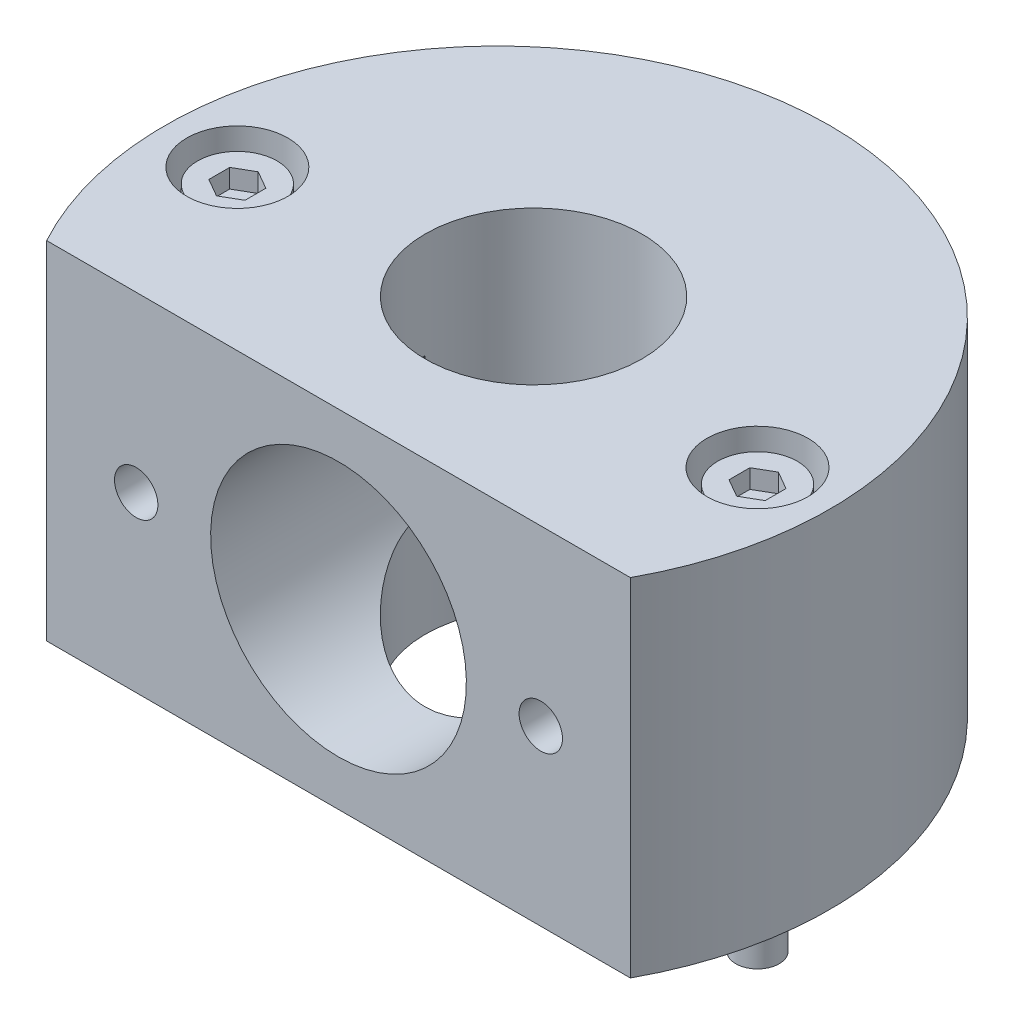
ISO-10303-21;
HEADER;
FILE_DESCRIPTION(('STEP AP214'),'2;1');
FILE_NAME('part.step','',(''),(''),'','','');
FILE_SCHEMA(('AUTOMOTIVE_DESIGN { 1 0 10303 214 1 1 1 1 }'));
ENDSEC;
DATA;
#1=APPLICATION_CONTEXT('core data for automotive mechanical design processes');
#2=APPLICATION_PROTOCOL_DEFINITION('international standard','automotive_design',2000,#1);
#3=PRODUCT_CONTEXT('',#1,'mechanical');
#4=PRODUCT('Part','Part','',(#3));
#5=PRODUCT_RELATED_PRODUCT_CATEGORY('part','',(#4));
#6=PRODUCT_DEFINITION_FORMATION('','',#4);
#7=PRODUCT_DEFINITION_CONTEXT('part definition',#1,'design');
#8=PRODUCT_DEFINITION('design','',#6,#7);
#9=PRODUCT_DEFINITION_SHAPE('','',#8);
#10=(LENGTH_UNIT() NAMED_UNIT(*) SI_UNIT(.MILLI.,.METRE.));
#11=(NAMED_UNIT(*) PLANE_ANGLE_UNIT() SI_UNIT($,.RADIAN.));
#12=(NAMED_UNIT(*) SI_UNIT($,.STERADIAN.) SOLID_ANGLE_UNIT());
#13=UNCERTAINTY_MEASURE_WITH_UNIT(LENGTH_MEASURE(1.E-05),#10,'distance_accuracy_value','');
#14=(GEOMETRIC_REPRESENTATION_CONTEXT(3) GLOBAL_UNCERTAINTY_ASSIGNED_CONTEXT((#13)) GLOBAL_UNIT_ASSIGNED_CONTEXT((#10,
#11,#12)) REPRESENTATION_CONTEXT('',''));
#15=CARTESIAN_POINT('',(0.,0.,0.));
#16=DIRECTION('',(0.,0.,1.));
#17=DIRECTION('',(1.,0.,0.));
#18=AXIS2_PLACEMENT_3D('',#15,#16,#17);
#19=CARTESIAN_POINT('',(0.,0.,0.));
#20=DIRECTION('',(0.,1.,0.));
#21=DIRECTION('',(-1.,0.,0.));
#22=AXIS2_PLACEMENT_3D('',#19,#20,#21);
#23=PLANE('',#22);
#24=CARTESIAN_POINT('',(-18.,-1.25693328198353E-13,0.));
#25=DIRECTION('',(0.,1.,0.));
#26=DIRECTION('',(-1.,0.,0.));
#27=AXIS2_PLACEMENT_3D('',#24,#25,#26);
#28=CIRCLE('',#27,1.75);
#29=CARTESIAN_POINT('',(-19.75,-1.37913512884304E-13,0.));
#30=VERTEX_POINT('',#29);
#31=EDGE_CURVE('E416',#30,#30,#28,.T.);
#32=ORIENTED_EDGE('',*,*,#31,.T.);
#33=EDGE_LOOP('',(#32));
#34=FACE_BOUND('',#33,.T.);
#35=CARTESIAN_POINT('',(0.,0.,-2.5));
#36=DIRECTION('',(0.,1.,0.));
#37=DIRECTION('',(-1.,0.,0.));
#38=AXIS2_PLACEMENT_3D('',#35,#36,#37);
#39=CIRCLE('',#38,7.5);
#40=CARTESIAN_POINT('',(-7.5,0.,-2.5));
#41=VERTEX_POINT('',#40);
#42=EDGE_CURVE('E420',#41,#41,#39,.T.);
#43=ORIENTED_EDGE('',*,*,#42,.T.);
#44=EDGE_LOOP('',(#43));
#45=FACE_BOUND('',#44,.T.);
#46=CARTESIAN_POINT('',(18.,1.25693328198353E-13,0.));
#47=DIRECTION('',(0.,1.,0.));
#48=DIRECTION('',(-1.,0.,0.));
#49=AXIS2_PLACEMENT_3D('',#46,#47,#48);
#50=CIRCLE('',#49,1.75);
#51=CARTESIAN_POINT('',(16.25,1.13473143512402E-13,0.));
#52=VERTEX_POINT('',#51);
#53=EDGE_CURVE('E423',#52,#52,#50,.T.);
#54=ORIENTED_EDGE('',*,*,#53,.T.);
#55=EDGE_LOOP('',(#54));
#56=FACE_BOUND('',#55,.T.);
#57=CARTESIAN_POINT('',(0.,0.,0.));
#58=DIRECTION('',(0.,1.,0.));
#59=DIRECTION('',(-1.,0.,0.));
#60=AXIS2_PLACEMENT_3D('',#57,#58,#59);
#61=CIRCLE('',#60,23.);
#62=CARTESIAN_POINT('',(20.1990098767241,1.79455226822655E-13,11.));
#63=VERTEX_POINT('',#62);
#64=CARTESIAN_POINT('',(-20.1990098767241,-1.02642637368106E-13,11.));
#65=VERTEX_POINT('',#64);
#66=EDGE_CURVE('E28',#63,#65,#61,.T.);
#67=ORIENTED_EDGE('',*,*,#66,.F.);
#68=DIRECTION('',(1.,0.,0.));
#69=VECTOR('',#68,1.);
#70=CARTESIAN_POINT('',(20.1990098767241,1.79455226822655E-13,11.));
#71=LINE('',#70,#69);
#72=EDGE_CURVE('E445',#65,#63,#71,.T.);
#73=ORIENTED_EDGE('',*,*,#72,.F.);
#74=EDGE_LOOP('',(#67,#73));
#75=FACE_BOUND('',#74,.T.);
#76=ADVANCED_FACE('F14',(#34,#45,#56,#75),#23,.F.);
#77=CARTESIAN_POINT('',(-15.3,12.,5.));
#78=DIRECTION('',(0.,0.,-1.));
#79=DIRECTION('',(0.,-1.,0.));
#80=AXIS2_PLACEMENT_3D('',#77,#78,#79);
#81=PLANE('',#80);
#82=CARTESIAN_POINT('',(-14.,12.,5.));
#83=DIRECTION('',(0.,0.,1.));
#84=DIRECTION('',(0.,1.,0.));
#85=AXIS2_PLACEMENT_3D('',#82,#83,#84);
#86=CIRCLE('',#85,1.5);
#87=CARTESIAN_POINT('',(-14.,13.5,4.99999999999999));
#88=VERTEX_POINT('',#87);
#89=EDGE_CURVE('E246',#88,#88,#86,.T.);
#90=ORIENTED_EDGE('',*,*,#89,.T.);
#91=EDGE_LOOP('',(#90));
#92=FACE_BOUND('',#91,.T.);
#93=ADVANCED_FACE('F292',(#92),#81,.F.);
#94=CARTESIAN_POINT('',(-14.,12.,11.));
#95=DIRECTION('',(0.,0.,1.));
#96=DIRECTION('',(0.,1.,0.));
#97=AXIS2_PLACEMENT_3D('',#94,#95,#96);
#98=CYLINDRICAL_SURFACE('',#97,1.5);
#99=ORIENTED_EDGE('',*,*,#89,.F.);
#100=EDGE_LOOP('',(#99));
#101=FACE_BOUND('',#100,.T.);
#102=CARTESIAN_POINT('',(-14.,12.,11.));
#103=DIRECTION('',(0.,0.,-1.));
#104=DIRECTION('',(0.,-1.,0.));
#105=AXIS2_PLACEMENT_3D('',#102,#103,#104);
#106=CIRCLE('',#105,1.5);
#107=CARTESIAN_POINT('',(-14.,10.5,11.));
#108=VERTEX_POINT('',#107);
#109=EDGE_CURVE('E235',#108,#108,#106,.F.);
#110=ORIENTED_EDGE('',*,*,#109,.T.);
#111=EDGE_LOOP('',(#110));
#112=FACE_BOUND('',#111,.T.);
#113=ADVANCED_FACE('F295',(#101,#112),#98,.F.);
#114=CARTESIAN_POINT('',(18.,24.,0.));
#115=DIRECTION('',(0.,1.,0.));
#116=DIRECTION('',(-1.,0.,0.));
#117=AXIS2_PLACEMENT_3D('',#114,#115,#116);
#118=CYLINDRICAL_SURFACE('',#117,1.75);
#119=CARTESIAN_POINT('',(18.,20.,0.));
#120=DIRECTION('',(0.,1.,0.));
#121=DIRECTION('',(-1.,0.,0.));
#122=AXIS2_PLACEMENT_3D('',#119,#120,#121);
#123=CIRCLE('',#122,1.75);
#124=CARTESIAN_POINT('',(16.25,20.,0.));
#125=VERTEX_POINT('',#124);
#126=EDGE_CURVE('E135',#125,#125,#123,.F.);
#127=ORIENTED_EDGE('',*,*,#126,.F.);
#128=EDGE_LOOP('',(#127));
#129=FACE_BOUND('',#128,.T.);
#130=ORIENTED_EDGE('',*,*,#53,.F.);
#131=EDGE_LOOP('',(#130));
#132=FACE_BOUND('',#131,.T.);
#133=ADVANCED_FACE('F311',(#129,#132),#118,.F.);
#134=CARTESIAN_POINT('',(14.4999999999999,20.,0.));
#135=DIRECTION('',(0.,-1.,0.));
#136=DIRECTION('',(1.,0.,0.));
#137=AXIS2_PLACEMENT_3D('',#134,#135,#136);
#138=PLANE('',#137);
#139=CARTESIAN_POINT('',(18.,20.,0.));
#140=DIRECTION('',(0.,-1.,0.));
#141=DIRECTION('',(1.,0.,0.));
#142=AXIS2_PLACEMENT_3D('',#139,#140,#141);
#143=CIRCLE('',#142,2.75);
#144=CARTESIAN_POINT('',(20.75,20.,0.));
#145=VERTEX_POINT('',#144);
#146=EDGE_CURVE('E9',#145,#145,#143,.F.);
#147=ORIENTED_EDGE('',*,*,#146,.F.);
#148=EDGE_LOOP('',(#147));
#149=FACE_BOUND('',#148,.T.);
#150=CARTESIAN_POINT('',(18.,20.,0.));
#151=DIRECTION('',(0.,1.,0.));
#152=DIRECTION('',(-1.,0.,0.));
#153=AXIS2_PLACEMENT_3D('',#150,#151,#152);
#154=CIRCLE('',#153,3.5);
#155=CARTESIAN_POINT('',(14.5,20.,0.));
#156=VERTEX_POINT('',#155);
#157=EDGE_CURVE('E236',#156,#156,#154,.T.);
#158=ORIENTED_EDGE('',*,*,#157,.T.);
#159=EDGE_LOOP('',(#158));
#160=FACE_BOUND('',#159,.T.);
#161=ADVANCED_FACE('F308',(#149,#160),#138,.F.);
#162=CARTESIAN_POINT('',(18.,24.,0.));
#163=DIRECTION('',(0.,1.,0.));
#164=DIRECTION('',(-1.,0.,0.));
#165=AXIS2_PLACEMENT_3D('',#162,#163,#164);
#166=CYLINDRICAL_SURFACE('',#165,3.5);
#167=ORIENTED_EDGE('',*,*,#157,.F.);
#168=EDGE_LOOP('',(#167));
#169=FACE_BOUND('',#168,.T.);
#170=CARTESIAN_POINT('',(18.,24.,0.));
#171=DIRECTION('',(0.,1.,0.));
#172=DIRECTION('',(-1.,0.,0.));
#173=AXIS2_PLACEMENT_3D('',#170,#171,#172);
#174=CIRCLE('',#173,3.5);
#175=CARTESIAN_POINT('',(14.5,24.,0.));
#176=VERTEX_POINT('',#175);
#177=EDGE_CURVE('E425',#176,#176,#174,.T.);
#178=ORIENTED_EDGE('',*,*,#177,.T.);
#179=EDGE_LOOP('',(#178));
#180=FACE_BOUND('',#179,.T.);
#181=ADVANCED_FACE('F301',(#169,#180),#166,.F.);
#182=CARTESIAN_POINT('',(12.7,12.,5.));
#183=DIRECTION('',(0.,0.,-1.));
#184=DIRECTION('',(0.,-1.,0.));
#185=AXIS2_PLACEMENT_3D('',#182,#183,#184);
#186=PLANE('',#185);
#187=CARTESIAN_POINT('',(14.,12.0000000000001,5.));
#188=DIRECTION('',(0.,0.,1.));
#189=DIRECTION('',(0.,1.,0.));
#190=AXIS2_PLACEMENT_3D('',#187,#188,#189);
#191=CIRCLE('',#190,1.5);
#192=CARTESIAN_POINT('',(14.,13.5000000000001,4.99999999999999));
#193=VERTEX_POINT('',#192);
#194=EDGE_CURVE('E243',#193,#193,#191,.T.);
#195=ORIENTED_EDGE('',*,*,#194,.T.);
#196=EDGE_LOOP('',(#195));
#197=FACE_BOUND('',#196,.T.);
#198=ADVANCED_FACE('F297',(#197),#186,.F.);
#199=CARTESIAN_POINT('',(14.,12.0000000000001,11.));
#200=DIRECTION('',(0.,0.,1.));
#201=DIRECTION('',(0.,1.,0.));
#202=AXIS2_PLACEMENT_3D('',#199,#200,#201);
#203=CYLINDRICAL_SURFACE('',#202,1.5);
#204=ORIENTED_EDGE('',*,*,#194,.F.);
#205=EDGE_LOOP('',(#204));
#206=FACE_BOUND('',#205,.T.);
#207=CARTESIAN_POINT('',(14.,12.0000000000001,11.));
#208=DIRECTION('',(0.,0.,-1.));
#209=DIRECTION('',(0.,-1.,0.));
#210=AXIS2_PLACEMENT_3D('',#207,#208,#209);
#211=CIRCLE('',#210,1.5);
#212=CARTESIAN_POINT('',(14.,10.5000000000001,11.));
#213=VERTEX_POINT('',#212);
#214=EDGE_CURVE('E240',#213,#213,#211,.F.);
#215=ORIENTED_EDGE('',*,*,#214,.T.);
#216=EDGE_LOOP('',(#215));
#217=FACE_BOUND('',#216,.T.);
#218=ADVANCED_FACE('F300',(#206,#217),#203,.F.);
#219=CARTESIAN_POINT('',(-1.6759110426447E-13,24.,0.));
#220=DIRECTION('',(0.,1.,0.));
#221=DIRECTION('',(-1.,0.,0.));
#222=AXIS2_PLACEMENT_3D('',#219,#220,#221);
#223=PLANE('',#222);
#224=ORIENTED_EDGE('',*,*,#177,.F.);
#225=EDGE_LOOP('',(#224));
#226=FACE_BOUND('',#225,.T.);
#227=CARTESIAN_POINT('',(-1.6759110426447E-13,24.,0.));
#228=DIRECTION('',(0.,1.,0.));
#229=DIRECTION('',(-1.,0.,0.));
#230=AXIS2_PLACEMENT_3D('',#227,#228,#229);
#231=CIRCLE('',#230,23.);
#232=CARTESIAN_POINT('',(-20.1990098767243,24.,11.));
#233=VERTEX_POINT('',#232);
#234=CARTESIAN_POINT('',(20.199009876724,24.,11.));
#235=VERTEX_POINT('',#234);
#236=EDGE_CURVE('E438',#233,#235,#231,.F.);
#237=ORIENTED_EDGE('',*,*,#236,.F.);
#238=DIRECTION('',(-1.,0.,0.));
#239=VECTOR('',#238,1.);
#240=CARTESIAN_POINT('',(-1.6759110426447E-13,24.,11.));
#241=LINE('',#240,#239);
#242=EDGE_CURVE('E435',#235,#233,#241,.T.);
#243=ORIENTED_EDGE('',*,*,#242,.F.);
#244=EDGE_LOOP('',(#237,#243));
#245=FACE_BOUND('',#244,.T.);
#246=CARTESIAN_POINT('',(-1.6759110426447E-13,24.,-2.50000000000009));
#247=DIRECTION('',(0.,1.,0.));
#248=DIRECTION('',(-1.,0.,0.));
#249=AXIS2_PLACEMENT_3D('',#246,#247,#248);
#250=CIRCLE('',#249,7.5);
#251=CARTESIAN_POINT('',(-7.50000000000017,23.9999999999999,-2.50000000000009));
#252=VERTEX_POINT('',#251);
#253=EDGE_CURVE('E491',#252,#252,#250,.T.);
#254=ORIENTED_EDGE('',*,*,#253,.F.);
#255=EDGE_LOOP('',(#254));
#256=FACE_BOUND('',#255,.T.);
#257=CARTESIAN_POINT('',(-18.,24.,0.));
#258=DIRECTION('',(0.,1.,0.));
#259=DIRECTION('',(-1.,0.,0.));
#260=AXIS2_PLACEMENT_3D('',#257,#258,#259);
#261=CIRCLE('',#260,3.5);
#262=CARTESIAN_POINT('',(-21.5,24.,0.));
#263=VERTEX_POINT('',#262);
#264=EDGE_CURVE('E441',#263,#263,#261,.T.);
#265=ORIENTED_EDGE('',*,*,#264,.F.);
#266=EDGE_LOOP('',(#265));
#267=FACE_BOUND('',#266,.T.);
#268=ADVANCED_FACE('F458',(#226,#245,#256,#267),#223,.T.);
#269=CARTESIAN_POINT('',(-1.6759110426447E-13,24.,0.));
#270=DIRECTION('',(0.,-1.,0.));
#271=DIRECTION('',(1.,0.,0.));
#272=AXIS2_PLACEMENT_3D('',#269,#270,#271);
#273=CYLINDRICAL_SURFACE('',#272,23.);
#274=DIRECTION('',(0.,-1.,0.));
#275=VECTOR('',#274,1.);
#276=CARTESIAN_POINT('',(20.199009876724,24.,11.));
#277=LINE('',#276,#275);
#278=EDGE_CURVE('E253',#235,#63,#277,.T.);
#279=ORIENTED_EDGE('',*,*,#278,.T.);
#280=ORIENTED_EDGE('',*,*,#66,.T.);
#281=DIRECTION('',(0.,-1.,0.));
#282=VECTOR('',#281,1.);
#283=CARTESIAN_POINT('',(-20.1990098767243,24.,11.));
#284=LINE('',#283,#282);
#285=EDGE_CURVE('E255',#233,#65,#284,.T.);
#286=ORIENTED_EDGE('',*,*,#285,.F.);
#287=ORIENTED_EDGE('',*,*,#236,.T.);
#288=EDGE_LOOP('',(#279,#280,#286,#287));
#289=FACE_BOUND('',#288,.T.);
#290=ADVANCED_FACE('F460',(#289),#273,.T.);
#291=CARTESIAN_POINT('',(20.199009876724,24.,11.));
#292=DIRECTION('',(0.,0.,-1.));
#293=DIRECTION('',(0.,-1.,0.));
#294=AXIS2_PLACEMENT_3D('',#291,#292,#293);
#295=PLANE('',#294);
#296=ORIENTED_EDGE('',*,*,#109,.F.);
#297=EDGE_LOOP('',(#296));
#298=FACE_BOUND('',#297,.T.);
#299=ORIENTED_EDGE('',*,*,#214,.F.);
#300=EDGE_LOOP('',(#299));
#301=FACE_BOUND('',#300,.T.);
#302=CARTESIAN_POINT('',(0.,12.,11.));
#303=DIRECTION('',(0.,0.,-1.));
#304=DIRECTION('',(0.,-1.,0.));
#305=AXIS2_PLACEMENT_3D('',#302,#303,#304);
#306=CIRCLE('',#305,8.85);
#307=CARTESIAN_POINT('',(0.,3.15,11.));
#308=VERTEX_POINT('',#307);
#309=EDGE_CURVE('E439',#308,#308,#306,.F.);
#310=ORIENTED_EDGE('',*,*,#309,.F.);
#311=EDGE_LOOP('',(#310));
#312=FACE_BOUND('',#311,.T.);
#313=ORIENTED_EDGE('',*,*,#285,.T.);
#314=ORIENTED_EDGE('',*,*,#72,.T.);
#315=ORIENTED_EDGE('',*,*,#278,.F.);
#316=ORIENTED_EDGE('',*,*,#242,.T.);
#317=EDGE_LOOP('',(#313,#314,#315,#316));
#318=FACE_BOUND('',#317,.T.);
#319=ADVANCED_FACE('F290',(#298,#301,#312,#318),#295,.F.);
#320=CARTESIAN_POINT('',(0.,12.,-2.50000000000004));
#321=DIRECTION('',(0.,0.,1.));
#322=DIRECTION('',(0.,1.,0.));
#323=AXIS2_PLACEMENT_3D('',#320,#321,#322);
#324=PLANE('',#323);
#325=CARTESIAN_POINT('',(0.,12.,-2.50000000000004));
#326=DIRECTION('',(0.,0.,1.));
#327=DIRECTION('',(0.,1.,0.));
#328=AXIS2_PLACEMENT_3D('',#325,#326,#327);
#329=CIRCLE('',#328,8.85);
#330=CARTESIAN_POINT('',(7.5,7.30186207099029,-2.5));
#331=VERTEX_POINT('',#330);
#332=CARTESIAN_POINT('',(7.49999999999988,16.6981379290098,-2.50000000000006));
#333=VERTEX_POINT('',#332);
#334=EDGE_CURVE('E249',#331,#333,#329,.T.);
#335=ORIENTED_EDGE('',*,*,#334,.T.);
#336=DIRECTION('',(0.,-1.,0.));
#337=VECTOR('',#336,1.);
#338=CARTESIAN_POINT('',(7.49999999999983,24.,-2.50000000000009));
#339=LINE('',#338,#337);
#340=EDGE_CURVE('E258',#331,#333,#339,.F.);
#341=ORIENTED_EDGE('',*,*,#340,.F.);
#342=EDGE_LOOP('',(#335,#341));
#343=FACE_BOUND('',#342,.T.);
#344=ADVANCED_FACE('F285',(#343),#324,.T.);
#345=CARTESIAN_POINT('',(-7.50000000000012,16.6981379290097,-2.50000000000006));
#346=VERTEX_POINT('',#345);
#347=CARTESIAN_POINT('',(-7.5,7.30186207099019,-2.5));
#348=VERTEX_POINT('',#347);
#349=EDGE_CURVE('E250',#346,#348,#329,.T.);
#350=ORIENTED_EDGE('',*,*,#349,.T.);
#351=DIRECTION('',(0.,-1.,0.));
#352=VECTOR('',#351,1.);
#353=CARTESIAN_POINT('',(-7.50000000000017,24.,-2.50000000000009));
#354=LINE('',#353,#352);
#355=EDGE_CURVE('E494',#346,#348,#354,.T.);
#356=ORIENTED_EDGE('',*,*,#355,.F.);
#357=EDGE_LOOP('',(#350,#356));
#358=FACE_BOUND('',#357,.T.);
#359=ADVANCED_FACE('F289',(#358),#324,.T.);
#360=CARTESIAN_POINT('',(-1.6759110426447E-13,24.,-2.50000000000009));
#361=DIRECTION('',(0.,-1.,0.));
#362=DIRECTION('',(1.,0.,0.));
#363=AXIS2_PLACEMENT_3D('',#360,#361,#362);
#364=CYLINDRICAL_SURFACE('',#363,7.5);
#365=ORIENTED_EDGE('',*,*,#42,.F.);
#366=EDGE_LOOP('',(#365));
#367=FACE_BOUND('',#366,.T.);
#368=ORIENTED_EDGE('',*,*,#253,.T.);
#369=EDGE_LOOP('',(#368));
#370=FACE_BOUND('',#369,.T.);
#371=CARTESIAN_POINT('',(7.49999999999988,16.6981379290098,-2.50000000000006));
#372=CARTESIAN_POINT('',(7.50003127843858,16.6980387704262,-2.3698160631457));
#373=CARTESIAN_POINT('',(7.49661192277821,16.7035464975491,-2.23969529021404));
#374=CARTESIAN_POINT('',(7.48312650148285,16.7249971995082,-1.98092204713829));
#375=CARTESIAN_POINT('',(7.47307403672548,16.7409188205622,-1.85226711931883));
#376=CARTESIAN_POINT('',(7.44677775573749,16.7821071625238,-1.59917710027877));
#377=CARTESIAN_POINT('',(7.43063099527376,16.8072272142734,-1.47470756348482));
#378=CARTESIAN_POINT('',(7.3924963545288,16.8656676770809,-1.22857835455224));
#379=CARTESIAN_POINT('',(7.3705050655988,16.8989928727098,-1.10692036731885));
#380=CARTESIAN_POINT('',(7.31079461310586,16.9878554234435,-0.817038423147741));
#381=CARTESIAN_POINT('',(7.27033594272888,17.0468711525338,-0.650444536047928));
#382=CARTESIAN_POINT('',(7.17945037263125,17.1753436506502,-0.324176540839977));
#383=CARTESIAN_POINT('',(7.12901921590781,17.244804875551,-0.164505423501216));
#384=CARTESIAN_POINT('',(7.01848282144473,17.3918387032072,0.149301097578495));
#385=CARTESIAN_POINT('',(6.95830182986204,17.4694730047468,0.30338054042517));
#386=CARTESIAN_POINT('',(6.82906771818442,17.6300063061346,0.604956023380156));
#387=CARTESIAN_POINT('',(6.76001163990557,17.7129070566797,0.752449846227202));
#388=CARTESIAN_POINT('',(6.57777492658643,17.9230873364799,1.11119698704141));
#389=CARTESIAN_POINT('',(6.45944119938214,18.0523845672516,1.31866693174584));
#390=CARTESIAN_POINT('',(6.20443168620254,18.313549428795,1.72038298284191));
#391=CARTESIAN_POINT('',(6.06774752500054,18.4454182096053,1.91462298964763));
#392=CARTESIAN_POINT('',(5.77651287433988,18.707661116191,2.28937048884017));
#393=CARTESIAN_POINT('',(5.62200465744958,18.8380380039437,2.46990885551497));
#394=CARTESIAN_POINT('',(5.29485883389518,19.0943735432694,2.81707765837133));
#395=CARTESIAN_POINT('',(5.12222852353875,19.2203339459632,2.98371364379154));
#396=CARTESIAN_POINT('',(4.79840490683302,19.4382233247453,3.2672332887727));
#397=CARTESIAN_POINT('',(4.65073492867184,19.53158791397,3.38704693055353));
#398=CARTESIAN_POINT('',(4.34436568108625,19.7123671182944,3.61662605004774));
#399=CARTESIAN_POINT('',(4.18566873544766,19.7997829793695,3.72639363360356));
#400=CARTESIAN_POINT('',(3.85762049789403,19.9671285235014,3.93478713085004));
#401=CARTESIAN_POINT('',(3.68828004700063,20.0470656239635,4.03342410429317));
#402=CARTESIAN_POINT('',(3.33927056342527,20.1980423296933,4.21850150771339));
#403=CARTESIAN_POINT('',(3.15960348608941,20.2690836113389,4.30494423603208));
#404=CARTESIAN_POINT('',(2.82351416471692,20.3890528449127,4.45018482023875));
#405=CARTESIAN_POINT('',(2.66863460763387,20.4396670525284,4.51116555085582));
#406=CARTESIAN_POINT('',(2.35306329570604,20.5330330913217,4.62327996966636));
#407=CARTESIAN_POINT('',(2.19237275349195,20.5757865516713,4.67441569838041));
#408=CARTESIAN_POINT('',(1.86604430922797,20.6526565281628,4.76612622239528));
#409=CARTESIAN_POINT('',(1.70040833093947,20.6867763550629,4.80670506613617));
#410=CARTESIAN_POINT('',(1.36515530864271,20.7457311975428,4.87669779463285));
#411=CARTESIAN_POINT('',(1.19553821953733,20.7705661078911,4.90611155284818));
#412=CARTESIAN_POINT('',(0.85275224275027,20.8105176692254,4.95338059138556));
#413=CARTESIAN_POINT('',(0.679570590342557,20.8255890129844,4.97118198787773));
#414=CARTESIAN_POINT('',(0.331797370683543,20.8454928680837,4.99468366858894));
#415=CARTESIAN_POINT('',(0.157205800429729,20.8503253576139,5.00038392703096));
#416=CARTESIAN_POINT('',(-0.191918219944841,20.849640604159,4.99957590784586));
#417=CARTESIAN_POINT('',(-0.366450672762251,20.844123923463,4.9930682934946));
#418=CARTESIAN_POINT('',(-0.714008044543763,20.822868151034,4.96796806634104));
#419=CARTESIAN_POINT('',(-0.88703302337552,20.8071294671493,4.94937593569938));
#420=CARTESIAN_POINT('',(-1.21762250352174,20.767300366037,4.90224300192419));
#421=CARTESIAN_POINT('',(-1.37539084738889,20.7439064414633,4.87453103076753));
#422=CARTESIAN_POINT('',(-1.68753886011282,20.6890640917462,4.80942148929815));
#423=CARTESIAN_POINT('',(-1.84191737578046,20.6576129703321,4.77202067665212));
#424=CARTESIAN_POINT('',(-2.14635050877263,20.587204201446,4.68805260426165));
#425=CARTESIAN_POINT('',(-2.29640643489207,20.5482488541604,4.64148815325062));
#426=CARTESIAN_POINT('',(-2.59159062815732,20.4634378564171,4.53974891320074));
#427=CARTESIAN_POINT('',(-2.73671703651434,20.4175796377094,4.48457091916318));
#428=CARTESIAN_POINT('',(-3.18655095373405,20.2628025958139,4.29754369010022));
#429=CARTESIAN_POINT('',(-3.48134461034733,20.1423781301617,4.15092967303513));
#430=CARTESIAN_POINT('',(-4.04191540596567,19.8791873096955,3.82599443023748));
#431=CARTESIAN_POINT('',(-4.30766947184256,19.7364034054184,3.64764828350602));
#432=CARTESIAN_POINT('',(-4.74547468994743,19.4733316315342,3.31257573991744));
#433=CARTESIAN_POINT('',(-4.92422807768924,19.3564843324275,3.16178511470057));
#434=CARTESIAN_POINT('',(-5.26481425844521,19.1167121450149,2.84654883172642));
#435=CARTESIAN_POINT('',(-5.42664645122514,18.9937870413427,2.68210268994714));
#436=CARTESIAN_POINT('',(-5.73374238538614,18.7443249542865,2.34015859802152));
#437=CARTESIAN_POINT('',(-5.87896958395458,18.6177807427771,2.162633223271));
#438=CARTESIAN_POINT('',(-6.15245710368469,18.3643135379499,1.79531139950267));
#439=CARTESIAN_POINT('',(-6.28072299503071,18.2373906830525,1.60551900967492));
#440=CARTESIAN_POINT('',(-6.49194881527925,18.0162010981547,1.25970782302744));
#441=CARTESIAN_POINT('',(-6.57846356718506,17.9212849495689,1.1062652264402));
#442=CARTESIAN_POINT('',(-6.74130989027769,17.7351997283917,0.791824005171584));
#443=CARTESIAN_POINT('',(-6.81764025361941,17.6440311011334,0.63082448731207));
#444=CARTESIAN_POINT('',(-6.95953859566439,17.4680948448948,0.301236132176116));
#445=CARTESIAN_POINT('',(-7.02512981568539,17.3833136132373,0.132664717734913));
#446=CARTESIAN_POINT('',(-7.14502220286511,17.2231368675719,-0.212624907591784));
#447=CARTESIAN_POINT('',(-7.19933007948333,17.147735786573,-0.389338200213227));
#448=CARTESIAN_POINT('',(-7.31009274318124,16.9896842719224,-0.805443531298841));
#449=CARTESIAN_POINT('',(-7.36236133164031,16.9115734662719,-1.04781644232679));
#450=CARTESIAN_POINT('',(-7.42288236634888,16.8191984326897,-1.41991234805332));
#451=CARTESIAN_POINT('',(-7.44006429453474,16.7925583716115,-1.54518830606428));
#452=CARTESIAN_POINT('',(-7.46815879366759,16.7486619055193,-1.7980424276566));
#453=CARTESIAN_POINT('',(-7.47907563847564,16.7313991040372,-1.92561896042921));
#454=CARTESIAN_POINT('',(-7.49113000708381,16.7122751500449,-2.12787232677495));
#455=CARTESIAN_POINT('',(-7.49445068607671,16.7069881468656,-2.20211442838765));
#456=CARTESIAN_POINT('',(-7.49888794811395,16.6999133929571,-2.35089942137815));
#457=CARTESIAN_POINT('',(-7.50000248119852,16.6981288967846,-2.42544252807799));
#458=CARTESIAN_POINT('',(-7.50000000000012,16.6981379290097,-2.50000000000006));
#459=B_SPLINE_CURVE_WITH_KNOTS('',3,(#371,#372,#373,#374,#375,#376,#377,#378,#379,#380,#381,
#382,#383,#384,#385,#386,#387,#388,#389,#390,#391,#392,#393,#394,#395,#396,#397,#398,#399,#400,
#401,#402,#403,#404,#405,#406,#407,#408,#409,#410,#411,#412,#413,#414,#415,#416,#417,#418,#419,
#420,#421,#422,#423,#424,#425,#426,#427,#428,#429,#430,#431,#432,#433,#434,#435,#436,#437,#438,
#439,#440,#441,#442,#443,#444,#445,#446,#447,#448,#449,#450,#451,#452,#453,#454,#455,#456,#457,
#458),.UNSPECIFIED.,.F.,.F.,(4,2,2,2,2,2,2,2,2,2,2,2,2,2,2,2,2,2,2,2,2,2,2,2,2,2,2,2,2,2,2,2,2,
2,2,2,2,2,2,2,2,2,2,4),(0.,0.390289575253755,0.779781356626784,1.16331541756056,
1.54707365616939,2.09010849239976,2.63337563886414,3.18108636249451,3.7289801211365,
4.54268863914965,5.35676980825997,6.16895848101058,6.98082139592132,7.61581117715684,
8.25066754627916,8.88488744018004,9.51898763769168,10.0404098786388,10.5617239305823,
11.0828377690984,11.6039575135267,12.1274784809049,12.6510005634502,13.1744942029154,
13.6979669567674,14.1830815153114,14.6683586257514,15.1534872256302,15.6387967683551,
16.686368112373,17.7347658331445,18.5180746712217,19.3014112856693,20.0864399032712,
20.8712100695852,21.4711111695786,22.0710833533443,22.6697394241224,23.2680384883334,
24.0446944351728,24.4319548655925,24.8189508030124,25.0423589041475,25.2659744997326),.UNSPECIFIED.);
#460=EDGE_CURVE('E270',#333,#346,#459,.T.);
#461=ORIENTED_EDGE('',*,*,#460,.T.);
#462=ORIENTED_EDGE('',*,*,#355,.T.);
#463=CARTESIAN_POINT('',(-7.5,7.30186207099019,-2.5));
#464=CARTESIAN_POINT('',(-7.50003127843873,7.30196122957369,-2.36981606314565));
#465=CARTESIAN_POINT('',(-7.49661192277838,7.29645350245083,-2.239695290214));
#466=CARTESIAN_POINT('',(-7.48312650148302,7.27500280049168,-1.98092204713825));
#467=CARTESIAN_POINT('',(-7.47307403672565,7.25908117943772,-1.85226711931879));
#468=CARTESIAN_POINT('',(-7.44677775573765,7.21789283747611,-1.59917710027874));
#469=CARTESIAN_POINT('',(-7.43063099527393,7.19277278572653,-1.47470756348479));
#470=CARTESIAN_POINT('',(-7.39249635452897,7.13433232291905,-1.22857835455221));
#471=CARTESIAN_POINT('',(-7.37050506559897,7.1010071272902,-1.10692036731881));
#472=CARTESIAN_POINT('',(-7.31079461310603,7.01214457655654,-0.817038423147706));
#473=CARTESIAN_POINT('',(-7.27033594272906,6.95312884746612,-0.650444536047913));
#474=CARTESIAN_POINT('',(-7.17945037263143,6.82465634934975,-0.324176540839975));
#475=CARTESIAN_POINT('',(-7.12901921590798,6.75519512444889,-0.164505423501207));
#476=CARTESIAN_POINT('',(-7.0184828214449,6.60816129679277,0.149301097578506));
#477=CARTESIAN_POINT('',(-6.95830182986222,6.53052699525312,0.303380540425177));
#478=CARTESIAN_POINT('',(-6.8290677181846,6.36999369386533,0.604956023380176));
#479=CARTESIAN_POINT('',(-6.76001163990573,6.28709294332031,0.752449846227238));
#480=CARTESIAN_POINT('',(-6.57777492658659,6.07691266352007,1.11119698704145));
#481=CARTESIAN_POINT('',(-6.45944119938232,5.94761543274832,1.31866693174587));
#482=CARTESIAN_POINT('',(-6.20443168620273,5.68645057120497,1.72038298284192));
#483=CARTESIAN_POINT('',(-6.06774752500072,5.55458179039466,1.91462298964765));
#484=CARTESIAN_POINT('',(-5.77651287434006,5.29233888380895,2.28937048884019));
#485=CARTESIAN_POINT('',(-5.62200465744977,5.16196199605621,2.46990885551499));
#486=CARTESIAN_POINT('',(-5.29485883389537,4.90562645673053,2.81707765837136));
#487=CARTESIAN_POINT('',(-5.12222852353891,4.77966605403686,2.98371364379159));
#488=CARTESIAN_POINT('',(-4.79840490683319,4.5617766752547,3.26723328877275));
#489=CARTESIAN_POINT('',(-4.65073492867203,4.46841208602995,3.38704693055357));
#490=CARTESIAN_POINT('',(-4.34436568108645,4.28763288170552,3.61662605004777));
#491=CARTESIAN_POINT('',(-4.18566873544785,4.2002170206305,3.72639363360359));
#492=CARTESIAN_POINT('',(-3.85762049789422,4.03287147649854,3.93478713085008));
#493=CARTESIAN_POINT('',(-3.68828004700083,3.95293437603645,4.03342410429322));
#494=CARTESIAN_POINT('',(-3.33927056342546,3.8019576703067,4.21850150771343));
#495=CARTESIAN_POINT('',(-3.15960348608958,3.73091638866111,4.30494423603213));
#496=CARTESIAN_POINT('',(-2.82351416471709,3.6109471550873,4.4501848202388));
#497=CARTESIAN_POINT('',(-2.66863460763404,3.56033294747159,4.51116555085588));
#498=CARTESIAN_POINT('',(-2.35306329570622,3.46696690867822,4.62327996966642));
#499=CARTESIAN_POINT('',(-2.19237275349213,3.42421344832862,4.67441569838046));
#500=CARTESIAN_POINT('',(-1.86604430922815,3.34734347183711,4.76612622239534));
#501=CARTESIAN_POINT('',(-1.70040833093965,3.31322364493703,4.80670506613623));
#502=CARTESIAN_POINT('',(-1.36515530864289,3.25426880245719,4.87669779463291));
#503=CARTESIAN_POINT('',(-1.1955382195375,3.22943389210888,4.90611155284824));
#504=CARTESIAN_POINT('',(-0.852752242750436,3.18948233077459,4.95338059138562));
#505=CARTESIAN_POINT('',(-0.679570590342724,3.17441098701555,4.97118198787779));
#506=CARTESIAN_POINT('',(-0.331797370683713,3.15450713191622,4.994683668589));
#507=CARTESIAN_POINT('',(-0.157205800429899,3.14967464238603,5.00038392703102));
#508=CARTESIAN_POINT('',(0.191918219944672,3.150359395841,4.99957590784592));
#509=CARTESIAN_POINT('',(0.366450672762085,3.15587607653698,4.99306829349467));
#510=CARTESIAN_POINT('',(0.714008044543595,3.17713184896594,4.96796806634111));
#511=CARTESIAN_POINT('',(0.887033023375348,3.19287053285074,4.94937593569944));
#512=CARTESIAN_POINT('',(1.21762250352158,3.23269963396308,4.90224300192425));
#513=CARTESIAN_POINT('',(1.37539084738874,3.25609355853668,4.87453103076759));
#514=CARTESIAN_POINT('',(1.68753886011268,3.31093590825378,4.80942148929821));
#515=CARTESIAN_POINT('',(1.84191737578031,3.34238702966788,4.77202067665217));
#516=CARTESIAN_POINT('',(2.14635050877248,3.41279579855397,4.6880526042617));
#517=CARTESIAN_POINT('',(2.29640643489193,3.45175114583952,4.64148815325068));
#518=CARTESIAN_POINT('',(2.59159062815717,3.53656214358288,4.53974891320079));
#519=CARTESIAN_POINT('',(2.73671703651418,3.5824203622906,4.48457091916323));
#520=CARTESIAN_POINT('',(3.18655095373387,3.73719740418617,4.29754369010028));
#521=CARTESIAN_POINT('',(3.48134461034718,3.85762186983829,4.15092967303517));
#522=CARTESIAN_POINT('',(4.04191540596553,4.12081269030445,3.82599443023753));
#523=CARTESIAN_POINT('',(4.30766947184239,4.26359659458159,3.64764828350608));
#524=CARTESIAN_POINT('',(4.74547468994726,4.5266683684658,3.31257573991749));
#525=CARTESIAN_POINT('',(4.92422807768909,4.64351566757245,3.1617851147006));
#526=CARTESIAN_POINT('',(5.26481425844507,4.88328785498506,2.84654883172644));
#527=CARTESIAN_POINT('',(5.426646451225,5.00621295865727,2.68210268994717));
#528=CARTESIAN_POINT('',(5.73374238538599,5.25567504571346,2.34015859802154));
#529=CARTESIAN_POINT('',(5.87896958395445,5.38221925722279,2.16263322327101));
#530=CARTESIAN_POINT('',(6.15245710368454,5.63568646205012,1.7953113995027));
#531=CARTESIAN_POINT('',(6.28072299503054,5.76260931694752,1.60551900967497));
#532=CARTESIAN_POINT('',(6.49194881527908,5.98379890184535,1.25970782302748));
#533=CARTESIAN_POINT('',(6.5784635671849,6.07871505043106,1.10626522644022));
#534=CARTESIAN_POINT('',(6.74130989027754,6.26480027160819,0.791824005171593));
#535=CARTESIAN_POINT('',(6.81764025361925,6.35596889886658,0.630824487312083));
#536=CARTESIAN_POINT('',(6.95953859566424,6.53190515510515,0.301236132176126));
#537=CARTESIAN_POINT('',(7.02512981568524,6.61668638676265,0.132664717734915));
#538=CARTESIAN_POINT('',(7.14502220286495,6.77686313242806,-0.212624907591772));
#539=CARTESIAN_POINT('',(7.19933007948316,6.85226421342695,-0.389338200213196));
#540=CARTESIAN_POINT('',(7.31009274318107,7.01031572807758,-0.8054435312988));
#541=CARTESIAN_POINT('',(7.36236133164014,7.08842653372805,-1.04781644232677));
#542=CARTESIAN_POINT('',(7.42288236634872,7.18080156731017,-1.41991234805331));
#543=CARTESIAN_POINT('',(7.44006429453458,7.20744162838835,-1.54518830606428));
#544=CARTESIAN_POINT('',(7.46815879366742,7.25133809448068,-1.79804242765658));
#545=CARTESIAN_POINT('',(7.47907563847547,7.26860089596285,-1.92561896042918));
#546=CARTESIAN_POINT('',(7.49113000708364,7.28772484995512,-2.12787232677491));
#547=CARTESIAN_POINT('',(7.49445068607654,7.29301185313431,-2.20211442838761));
#548=CARTESIAN_POINT('',(7.49888794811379,7.30008660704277,-2.3508994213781));
#549=CARTESIAN_POINT('',(7.50000248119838,7.30187110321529,-2.42544252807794));
#550=CARTESIAN_POINT('',(7.5,7.30186207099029,-2.5));
#551=B_SPLINE_CURVE_WITH_KNOTS('',3,(#463,#464,#465,#466,#467,#468,#469,#470,#471,#472,#473,
#474,#475,#476,#477,#478,#479,#480,#481,#482,#483,#484,#485,#486,#487,#488,#489,#490,#491,#492,
#493,#494,#495,#496,#497,#498,#499,#500,#501,#502,#503,#504,#505,#506,#507,#508,#509,#510,#511,
#512,#513,#514,#515,#516,#517,#518,#519,#520,#521,#522,#523,#524,#525,#526,#527,#528,#529,#530,
#531,#532,#533,#534,#535,#536,#537,#538,#539,#540,#541,#542,#543,#544,#545,#546,#547,#548,#549,
#550),.UNSPECIFIED.,.F.,.F.,(4,2,2,2,2,2,2,2,2,2,2,2,2,2,2,2,2,2,2,2,2,2,2,2,2,2,2,2,2,2,2,2,2,
2,2,2,2,2,2,2,2,2,2,4),(0.,0.390289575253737,0.779781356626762,1.16331541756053,
1.54707365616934,2.09010849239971,2.63337563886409,3.18108636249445,3.72898012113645,
4.5426886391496,5.35676980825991,6.16895848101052,6.98082139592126,7.61581117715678,
8.2506675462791,8.88488744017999,9.51898763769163,10.0404098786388,10.5617239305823,
11.0828377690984,11.6039575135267,12.1274784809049,12.6510005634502,13.1744942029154,
13.6979669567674,14.1830815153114,14.6683586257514,15.1534872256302,15.6387967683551,
16.686368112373,17.7347658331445,18.5180746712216,19.3014112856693,20.0864399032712,
20.8712100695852,21.4711111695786,22.0710833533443,22.6697394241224,23.2680384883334,
24.0446944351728,24.4319548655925,24.8189508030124,25.0423589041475,25.2659744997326),.UNSPECIFIED.);
#552=EDGE_CURVE('E261',#348,#331,#551,.T.);
#553=ORIENTED_EDGE('',*,*,#552,.T.);
#554=ORIENTED_EDGE('',*,*,#340,.T.);
#555=EDGE_LOOP('',(#461,#462,#553,#554));
#556=FACE_BOUND('',#555,.T.);
#557=ADVANCED_FACE('F276',(#367,#370,#556),#364,.F.);
#558=CARTESIAN_POINT('',(0.,12.,11.));
#559=DIRECTION('',(0.,0.,-1.));
#560=DIRECTION('',(0.,-1.,0.));
#561=AXIS2_PLACEMENT_3D('',#558,#559,#560);
#562=CYLINDRICAL_SURFACE('',#561,8.85);
#563=ORIENTED_EDGE('',*,*,#309,.T.);
#564=EDGE_LOOP('',(#563));
#565=FACE_BOUND('',#564,.T.);
#566=ORIENTED_EDGE('',*,*,#334,.F.);
#567=ORIENTED_EDGE('',*,*,#552,.F.);
#568=ORIENTED_EDGE('',*,*,#349,.F.);
#569=ORIENTED_EDGE('',*,*,#460,.F.);
#570=EDGE_LOOP('',(#566,#567,#568,#569));
#571=FACE_BOUND('',#570,.T.);
#572=ADVANCED_FACE('F279',(#565,#571),#562,.F.);
#573=CARTESIAN_POINT('',(-18.,24.,0.));
#574=DIRECTION('',(0.,1.,0.));
#575=DIRECTION('',(-1.,0.,0.));
#576=AXIS2_PLACEMENT_3D('',#573,#574,#575);
#577=CYLINDRICAL_SURFACE('',#576,3.5);
#578=CARTESIAN_POINT('',(-18.,20.,0.));
#579=DIRECTION('',(0.,1.,0.));
#580=DIRECTION('',(-1.,0.,0.));
#581=AXIS2_PLACEMENT_3D('',#578,#579,#580);
#582=CIRCLE('',#581,3.5);
#583=CARTESIAN_POINT('',(-21.5,20.,0.));
#584=VERTEX_POINT('',#583);
#585=EDGE_CURVE('E239',#584,#584,#582,.T.);
#586=ORIENTED_EDGE('',*,*,#585,.F.);
#587=EDGE_LOOP('',(#586));
#588=FACE_BOUND('',#587,.T.);
#589=ORIENTED_EDGE('',*,*,#264,.T.);
#590=EDGE_LOOP('',(#589));
#591=FACE_BOUND('',#590,.T.);
#592=ADVANCED_FACE('F283',(#588,#591),#577,.F.);
#593=CARTESIAN_POINT('',(-21.5,20.,0.));
#594=DIRECTION('',(0.,-1.,0.));
#595=DIRECTION('',(1.,0.,0.));
#596=AXIS2_PLACEMENT_3D('',#593,#594,#595);
#597=PLANE('',#596);
#598=CARTESIAN_POINT('',(-18.,20.,0.));
#599=DIRECTION('',(0.,-1.,0.));
#600=DIRECTION('',(1.,0.,0.));
#601=AXIS2_PLACEMENT_3D('',#598,#599,#600);
#602=CIRCLE('',#601,2.75);
#603=CARTESIAN_POINT('',(-15.25,20.,0.));
#604=VERTEX_POINT('',#603);
#605=EDGE_CURVE('E21',#604,#604,#602,.F.);
#606=ORIENTED_EDGE('',*,*,#605,.F.);
#607=EDGE_LOOP('',(#606));
#608=FACE_BOUND('',#607,.T.);
#609=ORIENTED_EDGE('',*,*,#585,.T.);
#610=EDGE_LOOP('',(#609));
#611=FACE_BOUND('',#610,.T.);
#612=ADVANCED_FACE('F303',(#608,#611),#597,.F.);
#613=CARTESIAN_POINT('',(-18.,24.,0.));
#614=DIRECTION('',(0.,1.,0.));
#615=DIRECTION('',(-1.,0.,0.));
#616=AXIS2_PLACEMENT_3D('',#613,#614,#615);
#617=CYLINDRICAL_SURFACE('',#616,1.75);
#618=CARTESIAN_POINT('',(-18.,20.,0.));
#619=DIRECTION('',(0.,1.,0.));
#620=DIRECTION('',(-1.,0.,0.));
#621=AXIS2_PLACEMENT_3D('',#618,#619,#620);
#622=CIRCLE('',#621,1.75);
#623=CARTESIAN_POINT('',(-19.75,20.,0.));
#624=VERTEX_POINT('',#623);
#625=EDGE_CURVE('E232',#624,#624,#622,.F.);
#626=ORIENTED_EDGE('',*,*,#625,.F.);
#627=EDGE_LOOP('',(#626));
#628=FACE_BOUND('',#627,.T.);
#629=ORIENTED_EDGE('',*,*,#31,.F.);
#630=EDGE_LOOP('',(#629));
#631=FACE_BOUND('',#630,.T.);
#632=ADVANCED_FACE('F306',(#628,#631),#617,.F.);
#633=CARTESIAN_POINT('',(-18.,-5.00000000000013,0.));
#634=DIRECTION('',(0.,1.,0.));
#635=DIRECTION('',(-1.,0.,0.));
#636=AXIS2_PLACEMENT_3D('',#633,#634,#635);
#637=PLANE('',#636);
#638=CARTESIAN_POINT('',(-18.,-5.00000000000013,0.));
#639=DIRECTION('',(0.,1.,0.));
#640=DIRECTION('',(-1.,0.,0.));
#641=AXIS2_PLACEMENT_3D('',#638,#639,#640);
#642=CIRCLE('',#641,1.5);
#643=CARTESIAN_POINT('',(-19.5,-5.00000000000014,0.));
#644=VERTEX_POINT('',#643);
#645=EDGE_CURVE('E224',#644,#644,#642,.T.);
#646=ORIENTED_EDGE('',*,*,#645,.F.);
#647=EDGE_LOOP('',(#646));
#648=FACE_BOUND('',#647,.T.);
#649=ADVANCED_FACE('F329',(#648),#637,.F.);
#650=CARTESIAN_POINT('',(-18.,-5.00000000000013,0.));
#651=DIRECTION('',(0.,1.,0.));
#652=DIRECTION('',(-1.,0.,0.));
#653=AXIS2_PLACEMENT_3D('',#650,#651,#652);
#654=CYLINDRICAL_SURFACE('',#653,1.5);
#655=ORIENTED_EDGE('',*,*,#645,.T.);
#656=EDGE_LOOP('',(#655));
#657=FACE_BOUND('',#656,.T.);
#658=CARTESIAN_POINT('',(-18.,20.,0.));
#659=DIRECTION('',(0.,1.,0.));
#660=DIRECTION('',(-1.,0.,0.));
#661=AXIS2_PLACEMENT_3D('',#658,#659,#660);
#662=CIRCLE('',#661,1.5);
#663=CARTESIAN_POINT('',(-19.5,20.,0.));
#664=VERTEX_POINT('',#663);
#665=EDGE_CURVE('E213',#664,#664,#662,.T.);
#666=ORIENTED_EDGE('',*,*,#665,.F.);
#667=EDGE_LOOP('',(#666));
#668=FACE_BOUND('',#667,.T.);
#669=ADVANCED_FACE('F321',(#657,#668),#654,.T.);
#670=CARTESIAN_POINT('',(-18.,20.,0.));
#671=DIRECTION('',(0.,1.,0.));
#672=DIRECTION('',(-1.,0.,0.));
#673=AXIS2_PLACEMENT_3D('',#670,#671,#672);
#674=PLANE('',#673);
#675=ORIENTED_EDGE('',*,*,#665,.T.);
#676=EDGE_LOOP('',(#675));
#677=FACE_BOUND('',#676,.T.);
#678=ORIENTED_EDGE('',*,*,#625,.T.);
#679=EDGE_LOOP('',(#678));
#680=FACE_BOUND('',#679,.T.);
#681=ADVANCED_FACE('F317',(#677,#680),#674,.F.);
#682=CARTESIAN_POINT('',(-18.,23.,0.));
#683=DIRECTION('',(0.,-1.,0.));
#684=DIRECTION('',(1.,0.,0.));
#685=AXIS2_PLACEMENT_3D('',#682,#683,#684);
#686=CYLINDRICAL_SURFACE('',#685,2.75);
#687=CARTESIAN_POINT('',(-18.,23.,0.));
#688=DIRECTION('',(0.,1.,0.));
#689=DIRECTION('',(-1.,0.,0.));
#690=AXIS2_PLACEMENT_3D('',#687,#688,#689);
#691=CIRCLE('',#690,2.75);
#692=CARTESIAN_POINT('',(-20.75,23.,0.));
#693=VERTEX_POINT('',#692);
#694=EDGE_CURVE('E227',#693,#693,#691,.T.);
#695=ORIENTED_EDGE('',*,*,#694,.F.);
#696=EDGE_LOOP('',(#695));
#697=FACE_BOUND('',#696,.T.);
#698=ORIENTED_EDGE('',*,*,#605,.T.);
#699=EDGE_LOOP('',(#698));
#700=FACE_BOUND('',#699,.T.);
#701=ADVANCED_FACE('F313',(#697,#700),#686,.T.);
#702=CARTESIAN_POINT('',(-18.,23.,0.));
#703=DIRECTION('',(0.,1.,0.));
#704=DIRECTION('',(-1.,0.,0.));
#705=AXIS2_PLACEMENT_3D('',#702,#703,#704);
#706=PLANE('',#705);
#707=DIRECTION('',(0.866025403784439,0.,0.5));
#708=VECTOR('',#707,1.);
#709=CARTESIAN_POINT('',(-19.25,23.,0.721687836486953));
#710=LINE('',#709,#708);
#711=CARTESIAN_POINT('',(-19.25,23.,0.721687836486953));
#712=VERTEX_POINT('',#711);
#713=CARTESIAN_POINT('',(-18.,23.,1.44337567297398));
#714=VERTEX_POINT('',#713);
#715=EDGE_CURVE('E175',#712,#714,#710,.T.);
#716=ORIENTED_EDGE('',*,*,#715,.F.);
#717=DIRECTION('',(0.,0.,1.));
#718=VECTOR('',#717,1.);
#719=CARTESIAN_POINT('',(-19.25,23.,-0.721687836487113));
#720=LINE('',#719,#718);
#721=CARTESIAN_POINT('',(-19.25,23.,-0.721687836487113));
#722=VERTEX_POINT('',#721);
#723=EDGE_CURVE('E180',#722,#712,#720,.T.);
#724=ORIENTED_EDGE('',*,*,#723,.F.);
#725=DIRECTION('',(-0.866025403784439,0.,0.5));
#726=VECTOR('',#725,1.);
#727=CARTESIAN_POINT('',(-18.,23.,-1.44337567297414));
#728=LINE('',#727,#726);
#729=CARTESIAN_POINT('',(-18.,23.,-1.44337567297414));
#730=VERTEX_POINT('',#729);
#731=EDGE_CURVE('E206',#730,#722,#728,.T.);
#732=ORIENTED_EDGE('',*,*,#731,.F.);
#733=DIRECTION('',(-0.866025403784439,0.,-0.5));
#734=VECTOR('',#733,1.);
#735=CARTESIAN_POINT('',(-16.75,23.,-0.721687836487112));
#736=LINE('',#735,#734);
#737=CARTESIAN_POINT('',(-16.75,23.,-0.721687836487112));
#738=VERTEX_POINT('',#737);
#739=EDGE_CURVE('E203',#738,#730,#736,.T.);
#740=ORIENTED_EDGE('',*,*,#739,.F.);
#741=DIRECTION('',(0.,0.,-1.));
#742=VECTOR('',#741,1.);
#743=CARTESIAN_POINT('',(-16.75,23.,0.721687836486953));
#744=LINE('',#743,#742);
#745=CARTESIAN_POINT('',(-16.75,23.,0.721687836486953));
#746=VERTEX_POINT('',#745);
#747=EDGE_CURVE('E200',#746,#738,#744,.T.);
#748=ORIENTED_EDGE('',*,*,#747,.F.);
#749=DIRECTION('',(0.866025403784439,0.,-0.5));
#750=VECTOR('',#749,1.);
#751=CARTESIAN_POINT('',(-18.,23.,1.44337567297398));
#752=LINE('',#751,#750);
#753=EDGE_CURVE('E197',#714,#746,#752,.T.);
#754=ORIENTED_EDGE('',*,*,#753,.F.);
#755=EDGE_LOOP('',(#716,#724,#732,#740,#748,#754));
#756=FACE_BOUND('',#755,.T.);
#757=ORIENTED_EDGE('',*,*,#694,.T.);
#758=EDGE_LOOP('',(#757));
#759=FACE_BOUND('',#758,.T.);
#760=ADVANCED_FACE('F316',(#756,#759),#706,.T.);
#761=CARTESIAN_POINT('',(-19.25,21.7,0.721687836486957));
#762=DIRECTION('',(-0.5,0.,0.866025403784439));
#763=DIRECTION('',(0.866025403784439,0.,0.5));
#764=AXIS2_PLACEMENT_3D('',#761,#762,#763);
#765=PLANE('',#764);
#766=ORIENTED_EDGE('',*,*,#715,.T.);
#767=DIRECTION('',(0.,1.,0.));
#768=VECTOR('',#767,1.);
#769=CARTESIAN_POINT('',(-18.,21.7,1.44337567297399));
#770=LINE('',#769,#768);
#771=CARTESIAN_POINT('',(-18.,21.7,1.44337567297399));
#772=VERTEX_POINT('',#771);
#773=EDGE_CURVE('E195',#772,#714,#770,.T.);
#774=ORIENTED_EDGE('',*,*,#773,.F.);
#775=DIRECTION('',(0.866025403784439,0.,0.5));
#776=VECTOR('',#775,1.);
#777=CARTESIAN_POINT('',(-19.25,21.7,0.721687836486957));
#778=LINE('',#777,#776);
#779=CARTESIAN_POINT('',(-19.25,21.7,0.721687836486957));
#780=VERTEX_POINT('',#779);
#781=EDGE_CURVE('E176',#780,#772,#778,.T.);
#782=ORIENTED_EDGE('',*,*,#781,.F.);
#783=DIRECTION('',(0.,1.,0.));
#784=VECTOR('',#783,1.);
#785=CARTESIAN_POINT('',(-19.25,21.7,0.721687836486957));
#786=LINE('',#785,#784);
#787=EDGE_CURVE('E211',#780,#712,#786,.T.);
#788=ORIENTED_EDGE('',*,*,#787,.T.);
#789=EDGE_LOOP('',(#766,#774,#782,#788));
#790=FACE_BOUND('',#789,.T.);
#791=ADVANCED_FACE('F325',(#790),#765,.F.);
#792=CARTESIAN_POINT('',(-19.25,21.7,-0.721687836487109));
#793=DIRECTION('',(-1.,0.,0.));
#794=DIRECTION('',(0.,0.,1.));
#795=AXIS2_PLACEMENT_3D('',#792,#793,#794);
#796=PLANE('',#795);
#797=ORIENTED_EDGE('',*,*,#723,.T.);
#798=ORIENTED_EDGE('',*,*,#787,.F.);
#799=DIRECTION('',(0.,0.,1.));
#800=VECTOR('',#799,1.);
#801=CARTESIAN_POINT('',(-19.25,21.7,-0.721687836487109));
#802=LINE('',#801,#800);
#803=CARTESIAN_POINT('',(-19.25,21.7,-0.721687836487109));
#804=VERTEX_POINT('',#803);
#805=EDGE_CURVE('E192',#804,#780,#802,.T.);
#806=ORIENTED_EDGE('',*,*,#805,.F.);
#807=DIRECTION('',(0.,1.,0.));
#808=VECTOR('',#807,1.);
#809=CARTESIAN_POINT('',(-19.25,21.7,-0.721687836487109));
#810=LINE('',#809,#808);
#811=EDGE_CURVE('E214',#804,#722,#810,.T.);
#812=ORIENTED_EDGE('',*,*,#811,.T.);
#813=EDGE_LOOP('',(#797,#798,#806,#812));
#814=FACE_BOUND('',#813,.T.);
#815=ADVANCED_FACE('F336',(#814),#796,.F.);
#816=CARTESIAN_POINT('',(-18.,21.7,-1.44337567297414));
#817=DIRECTION('',(-0.5,0.,-0.866025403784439));
#818=DIRECTION('',(-0.866025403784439,0.,0.5));
#819=AXIS2_PLACEMENT_3D('',#816,#817,#818);
#820=PLANE('',#819);
#821=ORIENTED_EDGE('',*,*,#731,.T.);
#822=ORIENTED_EDGE('',*,*,#811,.F.);
#823=DIRECTION('',(-0.866025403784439,0.,0.5));
#824=VECTOR('',#823,1.);
#825=CARTESIAN_POINT('',(-18.,21.7,-1.44337567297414));
#826=LINE('',#825,#824);
#827=CARTESIAN_POINT('',(-18.,21.7,-1.44337567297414));
#828=VERTEX_POINT('',#827);
#829=EDGE_CURVE('E189',#828,#804,#826,.T.);
#830=ORIENTED_EDGE('',*,*,#829,.F.);
#831=DIRECTION('',(0.,1.,0.));
#832=VECTOR('',#831,1.);
#833=CARTESIAN_POINT('',(-18.,21.7,-1.44337567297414));
#834=LINE('',#833,#832);
#835=EDGE_CURVE('E216',#828,#730,#834,.T.);
#836=ORIENTED_EDGE('',*,*,#835,.T.);
#837=EDGE_LOOP('',(#821,#822,#830,#836));
#838=FACE_BOUND('',#837,.T.);
#839=ADVANCED_FACE('F350',(#838),#820,.F.);
#840=CARTESIAN_POINT('',(-16.75,21.7,-0.721687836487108));
#841=DIRECTION('',(0.5,0.,-0.866025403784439));
#842=DIRECTION('',(-0.866025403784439,0.,-0.5));
#843=AXIS2_PLACEMENT_3D('',#840,#841,#842);
#844=PLANE('',#843);
#845=ORIENTED_EDGE('',*,*,#739,.T.);
#846=ORIENTED_EDGE('',*,*,#835,.F.);
#847=DIRECTION('',(-0.866025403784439,0.,-0.5));
#848=VECTOR('',#847,1.);
#849=CARTESIAN_POINT('',(-16.75,21.7,-0.721687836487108));
#850=LINE('',#849,#848);
#851=CARTESIAN_POINT('',(-16.75,21.7,-0.721687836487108));
#852=VERTEX_POINT('',#851);
#853=EDGE_CURVE('E186',#852,#828,#850,.T.);
#854=ORIENTED_EDGE('',*,*,#853,.F.);
#855=DIRECTION('',(0.,1.,0.));
#856=VECTOR('',#855,1.);
#857=CARTESIAN_POINT('',(-16.75,21.7,-0.721687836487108));
#858=LINE('',#857,#856);
#859=EDGE_CURVE('E218',#852,#738,#858,.T.);
#860=ORIENTED_EDGE('',*,*,#859,.T.);
#861=EDGE_LOOP('',(#845,#846,#854,#860));
#862=FACE_BOUND('',#861,.T.);
#863=ADVANCED_FACE('F346',(#862),#844,.F.);
#864=CARTESIAN_POINT('',(-16.75,21.7,0.721687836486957));
#865=DIRECTION('',(1.,0.,0.));
#866=DIRECTION('',(0.,1.,0.));
#867=AXIS2_PLACEMENT_3D('',#864,#865,#866);
#868=PLANE('',#867);
#869=ORIENTED_EDGE('',*,*,#747,.T.);
#870=ORIENTED_EDGE('',*,*,#859,.F.);
#871=DIRECTION('',(0.,0.,-1.));
#872=VECTOR('',#871,1.);
#873=CARTESIAN_POINT('',(-16.75,21.7,0.721687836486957));
#874=LINE('',#873,#872);
#875=CARTESIAN_POINT('',(-16.75,21.7,0.721687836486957));
#876=VERTEX_POINT('',#875);
#877=EDGE_CURVE('E183',#876,#852,#874,.T.);
#878=ORIENTED_EDGE('',*,*,#877,.F.);
#879=DIRECTION('',(0.,1.,0.));
#880=VECTOR('',#879,1.);
#881=CARTESIAN_POINT('',(-16.75,21.7,0.721687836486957));
#882=LINE('',#881,#880);
#883=EDGE_CURVE('E220',#876,#746,#882,.T.);
#884=ORIENTED_EDGE('',*,*,#883,.T.);
#885=EDGE_LOOP('',(#869,#870,#878,#884));
#886=FACE_BOUND('',#885,.T.);
#887=ADVANCED_FACE('F342',(#886),#868,.F.);
#888=CARTESIAN_POINT('',(-18.,21.7,1.44337567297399));
#889=DIRECTION('',(0.5,0.,0.866025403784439));
#890=DIRECTION('',(0.866025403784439,0.,-0.5));
#891=AXIS2_PLACEMENT_3D('',#888,#889,#890);
#892=PLANE('',#891);
#893=ORIENTED_EDGE('',*,*,#753,.T.);
#894=ORIENTED_EDGE('',*,*,#883,.F.);
#895=DIRECTION('',(0.866025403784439,0.,-0.5));
#896=VECTOR('',#895,1.);
#897=CARTESIAN_POINT('',(-18.,21.7,1.44337567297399));
#898=LINE('',#897,#896);
#899=EDGE_CURVE('E179',#772,#876,#898,.T.);
#900=ORIENTED_EDGE('',*,*,#899,.F.);
#901=ORIENTED_EDGE('',*,*,#773,.T.);
#902=EDGE_LOOP('',(#893,#894,#900,#901));
#903=FACE_BOUND('',#902,.T.);
#904=ADVANCED_FACE('F338',(#903),#892,.F.);
#905=CARTESIAN_POINT('',(-18.,21.7,0.));
#906=DIRECTION('',(0.,1.,0.));
#907=DIRECTION('',(-1.,0.,0.));
#908=AXIS2_PLACEMENT_3D('',#905,#906,#907);
#909=PLANE('',#908);
#910=ORIENTED_EDGE('',*,*,#781,.T.);
#911=ORIENTED_EDGE('',*,*,#899,.T.);
#912=ORIENTED_EDGE('',*,*,#877,.T.);
#913=ORIENTED_EDGE('',*,*,#853,.T.);
#914=ORIENTED_EDGE('',*,*,#829,.T.);
#915=ORIENTED_EDGE('',*,*,#805,.T.);
#916=EDGE_LOOP('',(#910,#911,#912,#913,#914,#915));
#917=FACE_BOUND('',#916,.T.);
#918=ADVANCED_FACE('F341',(#917),#909,.T.);
#919=CARTESIAN_POINT('',(18.,21.7,0.));
#920=DIRECTION('',(0.,1.,0.));
#921=DIRECTION('',(-1.,0.,0.));
#922=AXIS2_PLACEMENT_3D('',#919,#920,#921);
#923=PLANE('',#922);
#924=DIRECTION('',(0.866025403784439,0.,0.5));
#925=VECTOR('',#924,1.);
#926=CARTESIAN_POINT('',(16.75,21.7,0.721687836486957));
#927=LINE('',#926,#925);
#928=CARTESIAN_POINT('',(16.75,21.7,0.721687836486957));
#929=VERTEX_POINT('',#928);
#930=CARTESIAN_POINT('',(18.,21.7,1.44337567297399));
#931=VERTEX_POINT('',#930);
#932=EDGE_CURVE('E170',#929,#931,#927,.T.);
#933=ORIENTED_EDGE('',*,*,#932,.T.);
#934=DIRECTION('',(0.866025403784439,0.,-0.5));
#935=VECTOR('',#934,1.);
#936=CARTESIAN_POINT('',(18.,21.7,1.44337567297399));
#937=LINE('',#936,#935);
#938=CARTESIAN_POINT('',(19.25,21.7,0.721687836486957));
#939=VERTEX_POINT('',#938);
#940=EDGE_CURVE('E143',#931,#939,#937,.T.);
#941=ORIENTED_EDGE('',*,*,#940,.T.);
#942=DIRECTION('',(0.,0.,-1.));
#943=VECTOR('',#942,1.);
#944=CARTESIAN_POINT('',(19.25,21.7,0.721687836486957));
#945=LINE('',#944,#943);
#946=CARTESIAN_POINT('',(19.25,21.7,-0.721687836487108));
#947=VERTEX_POINT('',#946);
#948=EDGE_CURVE('E166',#939,#947,#945,.T.);
#949=ORIENTED_EDGE('',*,*,#948,.T.);
#950=DIRECTION('',(-0.866025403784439,0.,-0.5));
#951=VECTOR('',#950,1.);
#952=CARTESIAN_POINT('',(19.25,21.7,-0.721687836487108));
#953=LINE('',#952,#951);
#954=CARTESIAN_POINT('',(18.,21.7,-1.44337567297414));
#955=VERTEX_POINT('',#954);
#956=EDGE_CURVE('E163',#947,#955,#953,.T.);
#957=ORIENTED_EDGE('',*,*,#956,.T.);
#958=DIRECTION('',(-0.866025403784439,0.,0.5));
#959=VECTOR('',#958,1.);
#960=CARTESIAN_POINT('',(18.,21.7,-1.44337567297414));
#961=LINE('',#960,#959);
#962=CARTESIAN_POINT('',(16.75,21.7,-0.721687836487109));
#963=VERTEX_POINT('',#962);
#964=EDGE_CURVE('E160',#955,#963,#961,.T.);
#965=ORIENTED_EDGE('',*,*,#964,.T.);
#966=DIRECTION('',(0.,0.,1.));
#967=VECTOR('',#966,1.);
#968=CARTESIAN_POINT('',(16.75,21.7,-0.721687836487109));
#969=LINE('',#968,#967);
#970=EDGE_CURVE('E145',#963,#929,#969,.T.);
#971=ORIENTED_EDGE('',*,*,#970,.T.);
#972=EDGE_LOOP('',(#933,#941,#949,#957,#965,#971));
#973=FACE_BOUND('',#972,.T.);
#974=ADVANCED_FACE('F360',(#973),#923,.T.);
#975=CARTESIAN_POINT('',(18.,21.7,1.44337567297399));
#976=DIRECTION('',(0.5,0.,0.866025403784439));
#977=DIRECTION('',(0.866025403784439,0.,-0.5));
#978=AXIS2_PLACEMENT_3D('',#975,#976,#977);
#979=PLANE('',#978);
#980=DIRECTION('',(0.866025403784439,0.,-0.5));
#981=VECTOR('',#980,1.);
#982=CARTESIAN_POINT('',(18.,23.,1.44337567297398));
#983=LINE('',#982,#981);
#984=CARTESIAN_POINT('',(18.,23.,1.44337567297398));
#985=VERTEX_POINT('',#984);
#986=CARTESIAN_POINT('',(19.25,23.,0.721687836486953));
#987=VERTEX_POINT('',#986);
#988=EDGE_CURVE('E136',#985,#987,#983,.T.);
#989=ORIENTED_EDGE('',*,*,#988,.T.);
#990=DIRECTION('',(0.,1.,0.));
#991=VECTOR('',#990,1.);
#992=CARTESIAN_POINT('',(19.25,21.7,0.721687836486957));
#993=LINE('',#992,#991);
#994=EDGE_CURVE('E146',#939,#987,#993,.T.);
#995=ORIENTED_EDGE('',*,*,#994,.F.);
#996=ORIENTED_EDGE('',*,*,#940,.F.);
#997=DIRECTION('',(0.,1.,0.));
#998=VECTOR('',#997,1.);
#999=CARTESIAN_POINT('',(18.,21.7,1.44337567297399));
#1000=LINE('',#999,#998);
#1001=EDGE_CURVE('E128',#931,#985,#1000,.T.);
#1002=ORIENTED_EDGE('',*,*,#1001,.T.);
#1003=EDGE_LOOP('',(#989,#995,#996,#1002));
#1004=FACE_BOUND('',#1003,.T.);
#1005=ADVANCED_FACE('F140',(#1004),#979,.F.);
#1006=CARTESIAN_POINT('',(19.25,21.7,0.721687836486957));
#1007=DIRECTION('',(1.,0.,0.));
#1008=DIRECTION('',(0.,1.,0.));
#1009=AXIS2_PLACEMENT_3D('',#1006,#1007,#1008);
#1010=PLANE('',#1009);
#1011=DIRECTION('',(0.,0.,-1.));
#1012=VECTOR('',#1011,1.);
#1013=CARTESIAN_POINT('',(19.25,23.,0.721687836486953));
#1014=LINE('',#1013,#1012);
#1015=CARTESIAN_POINT('',(19.25,23.,-0.721687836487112));
#1016=VERTEX_POINT('',#1015);
#1017=EDGE_CURVE('E152',#987,#1016,#1014,.T.);
#1018=ORIENTED_EDGE('',*,*,#1017,.T.);
#1019=DIRECTION('',(0.,1.,0.));
#1020=VECTOR('',#1019,1.);
#1021=CARTESIAN_POINT('',(19.25,21.7,-0.721687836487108));
#1022=LINE('',#1021,#1020);
#1023=EDGE_CURVE('E788',#947,#1016,#1022,.T.);
#1024=ORIENTED_EDGE('',*,*,#1023,.F.);
#1025=ORIENTED_EDGE('',*,*,#948,.F.);
#1026=ORIENTED_EDGE('',*,*,#994,.T.);
#1027=EDGE_LOOP('',(#1018,#1024,#1025,#1026));
#1028=FACE_BOUND('',#1027,.T.);
#1029=ADVANCED_FACE('F376',(#1028),#1010,.F.);
#1030=CARTESIAN_POINT('',(19.25,21.7,-0.721687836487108));
#1031=DIRECTION('',(0.5,0.,-0.866025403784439));
#1032=DIRECTION('',(-0.866025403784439,0.,-0.5));
#1033=AXIS2_PLACEMENT_3D('',#1030,#1031,#1032);
#1034=PLANE('',#1033);
#1035=DIRECTION('',(-0.866025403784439,0.,-0.5));
#1036=VECTOR('',#1035,1.);
#1037=CARTESIAN_POINT('',(19.25,23.,-0.721687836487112));
#1038=LINE('',#1037,#1036);
#1039=CARTESIAN_POINT('',(18.,23.,-1.44337567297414));
#1040=VERTEX_POINT('',#1039);
#1041=EDGE_CURVE('E154',#1016,#1040,#1038,.T.);
#1042=ORIENTED_EDGE('',*,*,#1041,.T.);
#1043=DIRECTION('',(0.,1.,0.));
#1044=VECTOR('',#1043,1.);
#1045=CARTESIAN_POINT('',(18.,21.7,-1.44337567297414));
#1046=LINE('',#1045,#1044);
#1047=EDGE_CURVE('E790',#955,#1040,#1046,.T.);
#1048=ORIENTED_EDGE('',*,*,#1047,.F.);
#1049=ORIENTED_EDGE('',*,*,#956,.F.);
#1050=ORIENTED_EDGE('',*,*,#1023,.T.);
#1051=EDGE_LOOP('',(#1042,#1048,#1049,#1050));
#1052=FACE_BOUND('',#1051,.T.);
#1053=ADVANCED_FACE('F372',(#1052),#1034,.F.);
#1054=CARTESIAN_POINT('',(18.,21.7,-1.44337567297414));
#1055=DIRECTION('',(-0.5,0.,-0.866025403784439));
#1056=DIRECTION('',(-0.866025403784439,0.,0.5));
#1057=AXIS2_PLACEMENT_3D('',#1054,#1055,#1056);
#1058=PLANE('',#1057);
#1059=DIRECTION('',(-0.866025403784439,0.,0.5));
#1060=VECTOR('',#1059,1.);
#1061=CARTESIAN_POINT('',(18.,23.,-1.44337567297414));
#1062=LINE('',#1061,#1060);
#1063=CARTESIAN_POINT('',(16.75,23.,-0.721687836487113));
#1064=VERTEX_POINT('',#1063);
#1065=EDGE_CURVE('E796',#1040,#1064,#1062,.T.);
#1066=ORIENTED_EDGE('',*,*,#1065,.T.);
#1067=DIRECTION('',(0.,1.,0.));
#1068=VECTOR('',#1067,1.);
#1069=CARTESIAN_POINT('',(16.75,21.7,-0.721687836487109));
#1070=LINE('',#1069,#1068);
#1071=EDGE_CURVE('E792',#963,#1064,#1070,.T.);
#1072=ORIENTED_EDGE('',*,*,#1071,.F.);
#1073=ORIENTED_EDGE('',*,*,#964,.F.);
#1074=ORIENTED_EDGE('',*,*,#1047,.T.);
#1075=EDGE_LOOP('',(#1066,#1072,#1073,#1074));
#1076=FACE_BOUND('',#1075,.T.);
#1077=ADVANCED_FACE('F368',(#1076),#1058,.F.);
#1078=CARTESIAN_POINT('',(16.75,21.7,-0.721687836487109));
#1079=DIRECTION('',(-1.,0.,0.));
#1080=DIRECTION('',(0.,0.,1.));
#1081=AXIS2_PLACEMENT_3D('',#1078,#1079,#1080);
#1082=PLANE('',#1081);
#1083=DIRECTION('',(0.,0.,1.));
#1084=VECTOR('',#1083,1.);
#1085=CARTESIAN_POINT('',(16.75,23.,-0.721687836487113));
#1086=LINE('',#1085,#1084);
#1087=CARTESIAN_POINT('',(16.75,23.,0.721687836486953));
#1088=VERTEX_POINT('',#1087);
#1089=EDGE_CURVE('E172',#1064,#1088,#1086,.T.);
#1090=ORIENTED_EDGE('',*,*,#1089,.T.);
#1091=DIRECTION('',(0.,1.,0.));
#1092=VECTOR('',#1091,1.);
#1093=CARTESIAN_POINT('',(16.75,21.7,0.721687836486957));
#1094=LINE('',#1093,#1092);
#1095=EDGE_CURVE('E130',#929,#1088,#1094,.T.);
#1096=ORIENTED_EDGE('',*,*,#1095,.F.);
#1097=ORIENTED_EDGE('',*,*,#970,.F.);
#1098=ORIENTED_EDGE('',*,*,#1071,.T.);
#1099=EDGE_LOOP('',(#1090,#1096,#1097,#1098));
#1100=FACE_BOUND('',#1099,.T.);
#1101=ADVANCED_FACE('F365',(#1100),#1082,.F.);
#1102=CARTESIAN_POINT('',(16.75,21.7,0.721687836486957));
#1103=DIRECTION('',(-0.5,0.,0.866025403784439));
#1104=DIRECTION('',(0.866025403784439,0.,0.5));
#1105=AXIS2_PLACEMENT_3D('',#1102,#1103,#1104);
#1106=PLANE('',#1105);
#1107=DIRECTION('',(0.866025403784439,0.,0.5));
#1108=VECTOR('',#1107,1.);
#1109=CARTESIAN_POINT('',(16.75,23.,0.721687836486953));
#1110=LINE('',#1109,#1108);
#1111=EDGE_CURVE('E124',#1088,#985,#1110,.T.);
#1112=ORIENTED_EDGE('',*,*,#1111,.T.);
#1113=ORIENTED_EDGE('',*,*,#1001,.F.);
#1114=ORIENTED_EDGE('',*,*,#932,.F.);
#1115=ORIENTED_EDGE('',*,*,#1095,.T.);
#1116=EDGE_LOOP('',(#1112,#1113,#1114,#1115));
#1117=FACE_BOUND('',#1116,.T.);
#1118=ADVANCED_FACE('F126',(#1117),#1106,.F.);
#1119=CARTESIAN_POINT('',(18.,23.,0.));
#1120=DIRECTION('',(0.,1.,0.));
#1121=DIRECTION('',(-1.,0.,0.));
#1122=AXIS2_PLACEMENT_3D('',#1119,#1120,#1121);
#1123=PLANE('',#1122);
#1124=ORIENTED_EDGE('',*,*,#1111,.F.);
#1125=ORIENTED_EDGE('',*,*,#1089,.F.);
#1126=ORIENTED_EDGE('',*,*,#1065,.F.);
#1127=ORIENTED_EDGE('',*,*,#1041,.F.);
#1128=ORIENTED_EDGE('',*,*,#1017,.F.);
#1129=ORIENTED_EDGE('',*,*,#988,.F.);
#1130=EDGE_LOOP('',(#1124,#1125,#1126,#1127,#1128,#1129));
#1131=FACE_BOUND('',#1130,.T.);
#1132=CARTESIAN_POINT('',(18.,23.,0.));
#1133=DIRECTION('',(0.,1.,0.));
#1134=DIRECTION('',(-1.,0.,0.));
#1135=AXIS2_PLACEMENT_3D('',#1132,#1133,#1134);
#1136=CIRCLE('',#1135,2.75);
#1137=CARTESIAN_POINT('',(15.25,23.,0.));
#1138=VERTEX_POINT('',#1137);
#1139=EDGE_CURVE('E777',#1138,#1138,#1136,.T.);
#1140=ORIENTED_EDGE('',*,*,#1139,.T.);
#1141=EDGE_LOOP('',(#1140));
#1142=FACE_BOUND('',#1141,.T.);
#1143=ADVANCED_FACE('F148',(#1131,#1142),#1123,.T.);
#1144=CARTESIAN_POINT('',(18.,23.,0.));
#1145=DIRECTION('',(0.,-1.,0.));
#1146=DIRECTION('',(1.,0.,0.));
#1147=AXIS2_PLACEMENT_3D('',#1144,#1145,#1146);
#1148=CYLINDRICAL_SURFACE('',#1147,2.75);
#1149=ORIENTED_EDGE('',*,*,#1139,.F.);
#1150=EDGE_LOOP('',(#1149));
#1151=FACE_BOUND('',#1150,.T.);
#1152=ORIENTED_EDGE('',*,*,#146,.T.);
#1153=EDGE_LOOP('',(#1152));
#1154=FACE_BOUND('',#1153,.T.);
#1155=ADVANCED_FACE('F396',(#1151,#1154),#1148,.T.);
#1156=CARTESIAN_POINT('',(18.,20.,0.));
#1157=DIRECTION('',(0.,1.,0.));
#1158=DIRECTION('',(-1.,0.,0.));
#1159=AXIS2_PLACEMENT_3D('',#1156,#1157,#1158);
#1160=PLANE('',#1159);
#1161=CARTESIAN_POINT('',(18.,20.,0.));
#1162=DIRECTION('',(0.,1.,0.));
#1163=DIRECTION('',(-1.,0.,0.));
#1164=AXIS2_PLACEMENT_3D('',#1161,#1162,#1163);
#1165=CIRCLE('',#1164,1.5);
#1166=CARTESIAN_POINT('',(16.5,20.,0.));
#1167=VERTEX_POINT('',#1166);
#1168=EDGE_CURVE('E782',#1167,#1167,#1165,.T.);
#1169=ORIENTED_EDGE('',*,*,#1168,.T.);
#1170=EDGE_LOOP('',(#1169));
#1171=FACE_BOUND('',#1170,.T.);
#1172=ORIENTED_EDGE('',*,*,#126,.T.);
#1173=EDGE_LOOP('',(#1172));
#1174=FACE_BOUND('',#1173,.T.);
#1175=ADVANCED_FACE('F392',(#1171,#1174),#1160,.F.);
#1176=CARTESIAN_POINT('',(18.,-4.99999999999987,0.));
#1177=DIRECTION('',(0.,1.,0.));
#1178=DIRECTION('',(-1.,0.,0.));
#1179=AXIS2_PLACEMENT_3D('',#1176,#1177,#1178);
#1180=CYLINDRICAL_SURFACE('',#1179,1.5);
#1181=CARTESIAN_POINT('',(18.,-4.99999999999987,0.));
#1182=DIRECTION('',(0.,1.,0.));
#1183=DIRECTION('',(-1.,0.,0.));
#1184=AXIS2_PLACEMENT_3D('',#1181,#1182,#1183);
#1185=CIRCLE('',#1184,1.5);
#1186=CARTESIAN_POINT('',(16.5,-4.99999999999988,0.));
#1187=VERTEX_POINT('',#1186);
#1188=EDGE_CURVE('E779',#1187,#1187,#1185,.T.);
#1189=ORIENTED_EDGE('',*,*,#1188,.T.);
#1190=EDGE_LOOP('',(#1189));
#1191=FACE_BOUND('',#1190,.T.);
#1192=ORIENTED_EDGE('',*,*,#1168,.F.);
#1193=EDGE_LOOP('',(#1192));
#1194=FACE_BOUND('',#1193,.T.);
#1195=ADVANCED_FACE('F388',(#1191,#1194),#1180,.T.);
#1196=CARTESIAN_POINT('',(18.,-4.99999999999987,0.));
#1197=DIRECTION('',(0.,1.,0.));
#1198=DIRECTION('',(-1.,0.,0.));
#1199=AXIS2_PLACEMENT_3D('',#1196,#1197,#1198);
#1200=PLANE('',#1199);
#1201=ORIENTED_EDGE('',*,*,#1188,.F.);
#1202=EDGE_LOOP('',(#1201));
#1203=FACE_BOUND('',#1202,.T.);
#1204=ADVANCED_FACE('F385',(#1203),#1200,.F.);
#1205=CLOSED_SHELL('',(#76,#93,#113,#133,#161,#181,#198,#218,#268,#290,#319,#344,#359,#557,#572,
#592,#612,#632,#649,#669,#681,#701,#760,#791,#815,#839,#863,#887,#904,#918,#974,#1005,#1029,
#1053,#1077,#1101,#1118,#1143,#1155,#1175,#1195,#1204));
#1206=MANIFOLD_SOLID_BREP('B1',#1205);
#1207=ADVANCED_BREP_SHAPE_REPRESENTATION('',(#18,#1206),#14);
#1208=SHAPE_DEFINITION_REPRESENTATION(#9,#1207);
ENDSEC;
END-ISO-10303-21;
